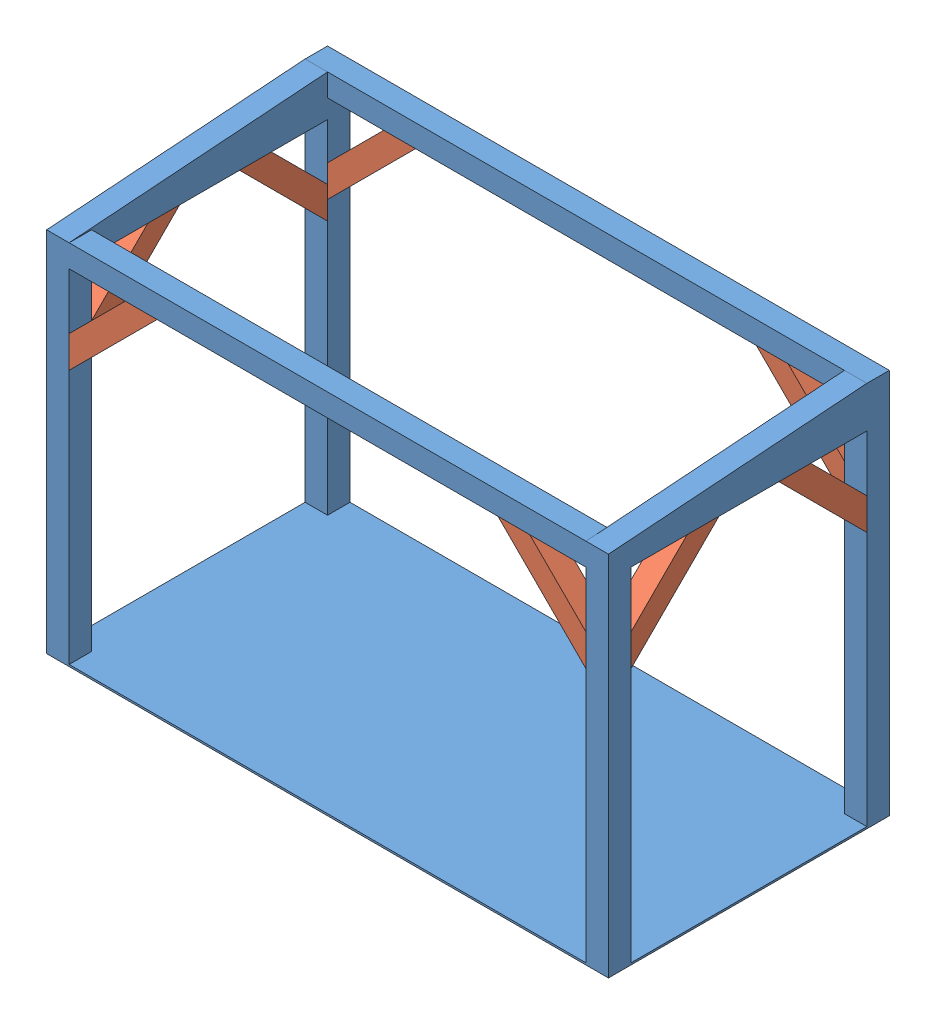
SolidWorks assembly abri-base-2.SLDASM, configuration Default (file format 14000). Lengths in mm.
Overall size (3000 2060 1500).
9 component instances, 2 part files, 16 mates.
Components (placement in the parent):
- sol-1: sol.SLDPRT [Default] at (631.8198 374.5167 2669.6807) size (3000 2060 1500)
- coin-1: coin.SLDPRT [Default] at (-748.1802 2214.5167 3299.6807) size (469.71 469.71 120)
- coin-2: coin.SLDPRT [Default] at (2011.8198 2214.5167 3419.6807) x (-1 0 0) z (0 0 -1) size (469.71 469.71 120)
- coin-3: coin.SLDPRT [Default] at (-748.1802 2314.5167 1919.6807) size (469.71 469.71 120)
- coin-4: coin.SLDPRT [Default] at (2011.8198 2314.5167 2039.6807) x (-1 0 0) z (0 0 -1) size (469.71 469.71 120)
- coin-5: coin.SLDPRT [Default] at (2131.8198 2214.5167 2039.6807) x (0 0 1) z (-1 0 0) size (469.71 469.71 120)
- coin-6: coin.SLDPRT [Default] at (2011.8198 2214.5167 3299.6807) x (0 0 -1) z (1 0 0) size (469.71 469.71 120)
- coin-7: coin.SLDPRT [Default] at (-748.1802 2214.5167 2039.6807) x (0 0 1) z (-1 0 0) size (469.71 469.71 120)
- coin-8: coin.SLDPRT [Default] at (-868.1802 2214.5167 3299.6807) x (0 0 -1) z (1 0 0) size (469.71 469.71 120)
Mates (geometry in assembly coordinates):
- Coïncidente2: coincident aligned: line of sol-1 through (-748.1802 2214.5167 3419.6807) axis (0 -1 0); line of coin-1 through (-748.1802 1914.5167 3419.6807) axis (0 -1 0)
- Coïncidente4: coincident aligned: line of sol-1 through (2011.8198 2214.5167 3419.6807) axis (0 -1 0); line of coin-2 through (2011.8198 1914.5167 3419.6807) axis (0 -1 0)
- Coïncidente7: coincident aligned: line of sol-1 through (-748.1802 2314.5167 1919.6807) axis (0 -1 0); line of coin-3 through (-748.1802 2014.5167 1919.6807) axis (0 -1 0)
- Coïncidente8: coincident aligned: line of sol-1 through (2011.8198 2314.5167 1919.6807) axis (0 -1 0); line of coin-4 through (2011.8198 2014.5167 1919.6807) axis (0 -1 0)
- Coïncidente10: coincident aligned: line of sol-1 through (2131.8198 2214.5167 2039.6807) axis (0 -1 0); line of coin-5 through (2131.8198 1914.5167 2039.6807) axis (0 -1 0)
- Coïncidente13: coincident aligned: line of sol-1 through (2131.8198 2214.5167 3299.6807) axis (0 -1 0); line of coin-6 through (2131.8198 1914.5167 3299.6807) axis (0 -1 0)
- Coïncidente14: coincident anti-aligned: line of sol-1 through (2131.8198 2214.5167 3299.6807) axis (0 0 -1); line of coin-6 through (2131.8198 2214.5167 2829.9751) axis (0 0 1)
- Coïncidente15: coincident aligned: line of sol-1 through (2131.8198 2214.5167 3299.6807) axis (0 0 -1); line of coin-5 through (2131.8198 2214.5167 2509.3863) axis (0 0 -1)
- Coïncidente16: coincident aligned: line of sol-1 through (-748.1802 2314.5167 1919.6807) axis (1 0 0); line of coin-4 through (1542.1142 2314.5167 1919.6807) axis (1 0 0)
- Coïncidente17: coincident anti-aligned: line of sol-1 through (-748.1802 2314.5167 1919.6807) axis (1 0 0); line of coin-3 through (-278.4746 2314.5167 1919.6807) axis (-1 0 0)
- Coïncidente19: coincident aligned: line of sol-1 through (2011.8198 2214.5167 3419.6807) axis (-1 0 0); line of coin-1 through (-278.4746 2214.5167 3419.6807) axis (-1 0 0)
- Coïncidente20: coincident anti-aligned: line of sol-1 through (2011.8198 2214.5167 3419.6807) axis (-1 0 0); line of coin-2 through (1542.1142 2214.5167 3419.6807) axis (1 0 0)
- Coïncidente22: coincident aligned: line of sol-1 through (-868.1802 2214.5167 3299.6807) axis (0 0 -1); line of coin-7 through (-868.1802 2214.5167 2509.3863) axis (0 0 -1)
- Coïncidente23: coincident aligned: line of sol-1 through (-868.1802 2214.5167 2039.6807) axis (0 -1 0); line of coin-7 through (-868.1802 1914.5167 2039.6807) axis (0 -1 0)
- Coïncidente26: coincident aligned: line of sol-1 through (-868.1802 2214.5167 3299.6807) axis (0 -1 0); line of coin-8 through (-868.1802 1914.5167 3299.6807) axis (0 -1 0)
- Coïncidente27: coincident anti-aligned: line of sol-1 through (-868.1802 2214.5167 3299.6807) axis (0 0 -1); line of coin-8 through (-868.1802 2214.5167 2829.9751) axis (0 0 1)
